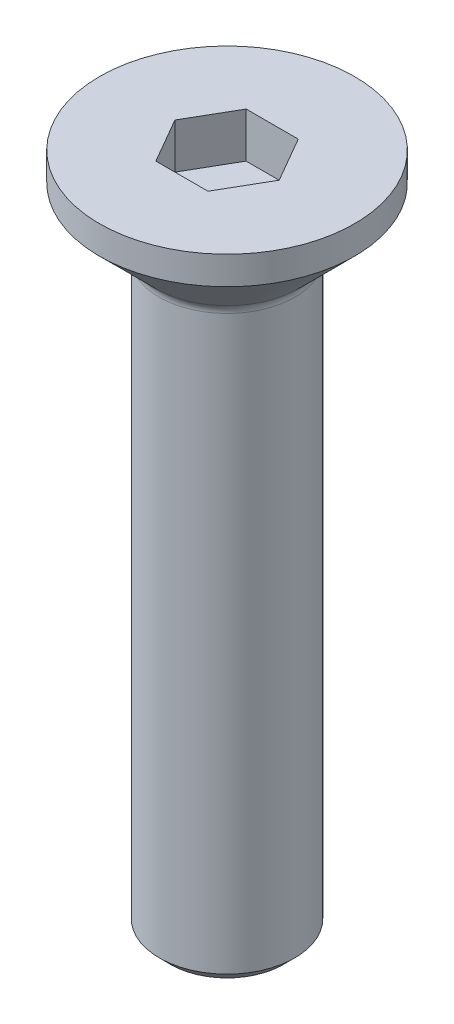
from build123d import *

# Parameters (mm, degrees)
ENL_V_MAT_EXTRU_1_DEPTH = 2


with BuildPart() as part:
    # Esquisse1 → R_volution1 (revolve)
    with BuildSketch(Plane.XY, mode=Mode.PRIVATE) as r_volution1_sk:
        with BuildLine():
            Line((5.65, -1.25), (3.175735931, -3.724264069))
            ThreePointArc((3.175735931, -3.724264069), (3.04567228, -3.918918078), (3, -4.148528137))
            Line((3, -4.148528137), (3, -29.5))
            Line((3, -29.5), (2.5, -30))
            Line((2.5, -30), (0, -30))
            Line((0, -30), (0, 0))
            Line((0, 0), (5.65, 0))
            Line((5.65, 0), (5.65, -1.25))
        make_face()
    revolve(r_volution1_sk.sketch.rotate(Axis((0, 0, 0), (0, -1, 0)), 180), axis=Axis((0, 0, 0), (0, -1, 0)))

    # Esquisse2 → Enl_v. mat.-Extru.1 (cut)
    with BuildSketch(Plane(origin=(0, 0, 0), x_dir=(1, 0, 0), z_dir=(0, 1, 0))):
        Polygon((2.309401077, 0), (1.154700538, 2), (-1.154700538, 2), (-2.309401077, 0), (-1.154700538, -2), (1.154700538, -2), align=None)
    extrude(amount=-ENL_V_MAT_EXTRU_1_DEPTH, mode=Mode.SUBTRACT)


solid = part.part
